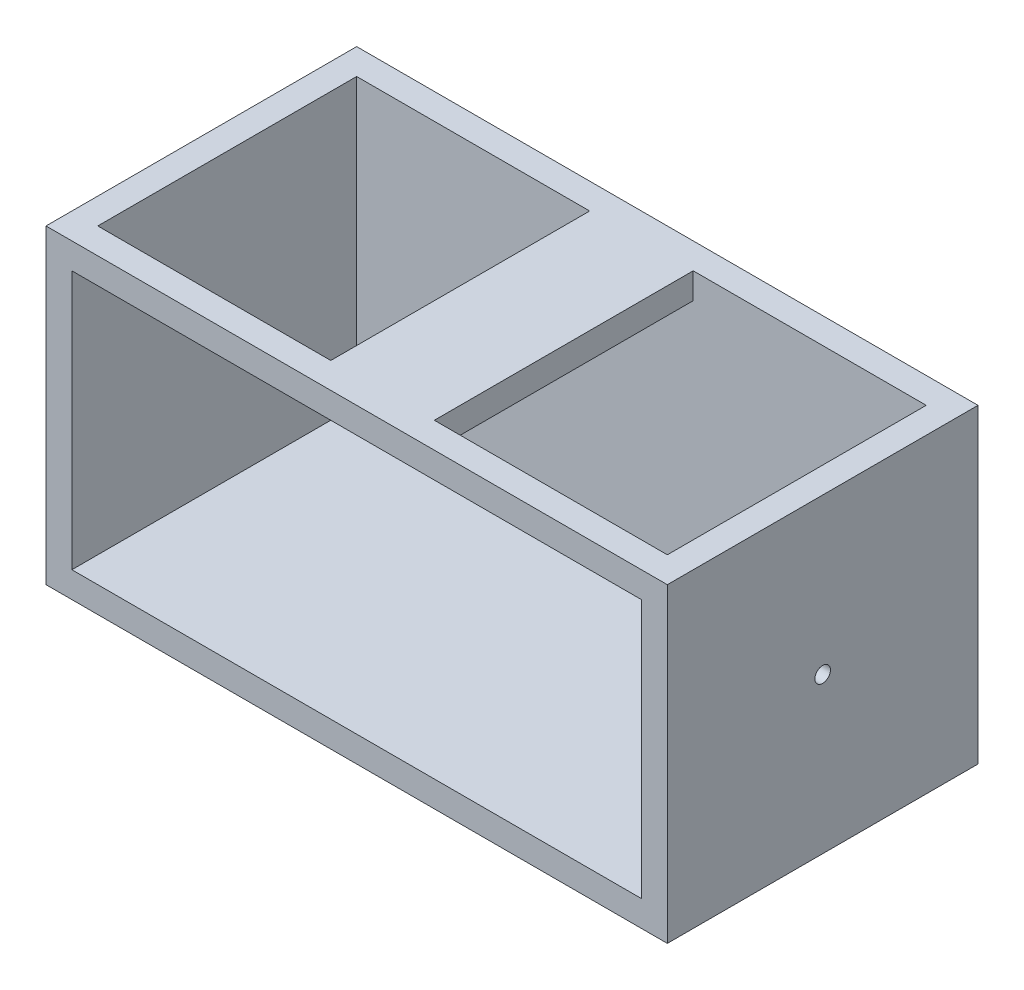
ISO-10303-21;
HEADER;
FILE_DESCRIPTION(('STEP AP214'),'2;1');
FILE_NAME('part.step','',(''),(''),'','','');
FILE_SCHEMA(('AUTOMOTIVE_DESIGN { 1 0 10303 214 1 1 1 1 }'));
ENDSEC;
DATA;
#1=APPLICATION_CONTEXT('core data for automotive mechanical design processes');
#2=APPLICATION_PROTOCOL_DEFINITION('international standard','automotive_design',2000,#1);
#3=PRODUCT_CONTEXT('',#1,'mechanical');
#4=PRODUCT('Part','Part','',(#3));
#5=PRODUCT_RELATED_PRODUCT_CATEGORY('part','',(#4));
#6=PRODUCT_DEFINITION_FORMATION('','',#4);
#7=PRODUCT_DEFINITION_CONTEXT('part definition',#1,'design');
#8=PRODUCT_DEFINITION('design','',#6,#7);
#9=PRODUCT_DEFINITION_SHAPE('','',#8);
#10=(LENGTH_UNIT() NAMED_UNIT(*) SI_UNIT(.MILLI.,.METRE.));
#11=(NAMED_UNIT(*) PLANE_ANGLE_UNIT() SI_UNIT($,.RADIAN.));
#12=(NAMED_UNIT(*) SI_UNIT($,.STERADIAN.) SOLID_ANGLE_UNIT());
#13=UNCERTAINTY_MEASURE_WITH_UNIT(LENGTH_MEASURE(1.E-05),#10,'distance_accuracy_value','');
#14=(GEOMETRIC_REPRESENTATION_CONTEXT(3) GLOBAL_UNCERTAINTY_ASSIGNED_CONTEXT((#13)) GLOBAL_UNIT_ASSIGNED_CONTEXT((#10,
#11,#12)) REPRESENTATION_CONTEXT('',''));
#15=CARTESIAN_POINT('',(0.,0.,0.));
#16=DIRECTION('',(0.,0.,1.));
#17=DIRECTION('',(1.,0.,0.));
#18=AXIS2_PLACEMENT_3D('',#15,#16,#17);
#19=CARTESIAN_POINT('',(-135.,0.,60.));
#20=DIRECTION('',(1.,0.,0.));
#21=DIRECTION('',(0.,0.,-1.));
#22=AXIS2_PLACEMENT_3D('',#19,#20,#21);
#23=CYLINDRICAL_SURFACE('',#22,3.);
#24=CARTESIAN_POINT('',(-120.,0.,60.));
#25=DIRECTION('',(1.,0.,0.));
#26=DIRECTION('',(0.,0.,-1.));
#27=AXIS2_PLACEMENT_3D('',#24,#25,#26);
#28=CIRCLE('',#27,3.);
#29=CARTESIAN_POINT('',(-120.,0.,57.));
#30=VERTEX_POINT('',#29);
#31=EDGE_CURVE('E260',#30,#30,#28,.T.);
#32=ORIENTED_EDGE('',*,*,#31,.F.);
#33=EDGE_LOOP('',(#32));
#34=FACE_BOUND('',#33,.T.);
#35=CARTESIAN_POINT('',(-110.,0.,60.));
#36=DIRECTION('',(1.,0.,0.));
#37=DIRECTION('',(0.,0.,-1.));
#38=AXIS2_PLACEMENT_3D('',#35,#36,#37);
#39=CIRCLE('',#38,3.);
#40=CARTESIAN_POINT('',(-110.,0.,57.));
#41=VERTEX_POINT('',#40);
#42=EDGE_CURVE('E210',#41,#41,#39,.F.);
#43=ORIENTED_EDGE('',*,*,#42,.F.);
#44=EDGE_LOOP('',(#43));
#45=FACE_BOUND('',#44,.T.);
#46=ADVANCED_FACE('F41',(#34,#45),#23,.F.);
#47=CARTESIAN_POINT('',(120.,0.,60.));
#48=DIRECTION('',(1.,0.,0.));
#49=DIRECTION('',(0.,0.,-1.));
#50=AXIS2_PLACEMENT_3D('',#47,#48,#49);
#51=CIRCLE('',#50,3.);
#52=CARTESIAN_POINT('',(120.,0.,57.));
#53=VERTEX_POINT('',#52);
#54=EDGE_CURVE('E222',#53,#53,#51,.T.);
#55=ORIENTED_EDGE('',*,*,#54,.T.);
#56=EDGE_LOOP('',(#55));
#57=FACE_BOUND('',#56,.T.);
#58=CARTESIAN_POINT('',(110.,0.,60.));
#59=DIRECTION('',(-1.,0.,0.));
#60=DIRECTION('',(0.,0.,1.));
#61=AXIS2_PLACEMENT_3D('',#58,#59,#60);
#62=CIRCLE('',#61,3.);
#63=CARTESIAN_POINT('',(110.,0.,63.));
#64=VERTEX_POINT('',#63);
#65=EDGE_CURVE('E206',#64,#64,#62,.F.);
#66=ORIENTED_EDGE('',*,*,#65,.F.);
#67=EDGE_LOOP('',(#66));
#68=FACE_BOUND('',#67,.T.);
#69=ADVANCED_FACE('F310',(#57,#68),#23,.F.);
#70=CARTESIAN_POINT('',(0.,0.,120.));
#71=DIRECTION('',(0.,0.,-1.));
#72=DIRECTION('',(-1.,0.,0.));
#73=AXIS2_PLACEMENT_3D('',#70,#71,#72);
#74=PLANE('',#73);
#75=DIRECTION('',(0.,1.,0.));
#76=VECTOR('',#75,1.);
#77=CARTESIAN_POINT('',(120.,-60.,120.));
#78=LINE('',#77,#76);
#79=CARTESIAN_POINT('',(120.,-60.,120.));
#80=VERTEX_POINT('',#79);
#81=CARTESIAN_POINT('',(120.,60.,120.));
#82=VERTEX_POINT('',#81);
#83=EDGE_CURVE('E261',#80,#82,#78,.T.);
#84=ORIENTED_EDGE('',*,*,#83,.T.);
#85=DIRECTION('',(-1.,0.,0.));
#86=VECTOR('',#85,1.);
#87=CARTESIAN_POINT('',(-120.,60.,120.));
#88=LINE('',#87,#86);
#89=CARTESIAN_POINT('',(-120.,60.,120.));
#90=VERTEX_POINT('',#89);
#91=EDGE_CURVE('E265',#82,#90,#88,.T.);
#92=ORIENTED_EDGE('',*,*,#91,.T.);
#93=DIRECTION('',(0.,-1.,0.));
#94=VECTOR('',#93,1.);
#95=CARTESIAN_POINT('',(-120.,-60.,120.));
#96=LINE('',#95,#94);
#97=CARTESIAN_POINT('',(-120.,-60.,120.));
#98=VERTEX_POINT('',#97);
#99=EDGE_CURVE('E269',#90,#98,#96,.T.);
#100=ORIENTED_EDGE('',*,*,#99,.T.);
#101=DIRECTION('',(1.,0.,0.));
#102=VECTOR('',#101,1.);
#103=CARTESIAN_POINT('',(-120.,-60.,120.));
#104=LINE('',#103,#102);
#105=EDGE_CURVE('E272',#98,#80,#104,.T.);
#106=ORIENTED_EDGE('',*,*,#105,.T.);
#107=EDGE_LOOP('',(#84,#92,#100,#106));
#108=FACE_BOUND('',#107,.T.);
#109=DIRECTION('',(0.,1.,0.));
#110=VECTOR('',#109,1.);
#111=CARTESIAN_POINT('',(110.,0.,120.));
#112=LINE('',#111,#110);
#113=CARTESIAN_POINT('',(110.,-50.,120.));
#114=VERTEX_POINT('',#113);
#115=CARTESIAN_POINT('',(110.,50.,120.));
#116=VERTEX_POINT('',#115);
#117=EDGE_CURVE('E245',#114,#116,#112,.T.);
#118=ORIENTED_EDGE('',*,*,#117,.F.);
#119=DIRECTION('',(1.,0.,0.));
#120=VECTOR('',#119,1.);
#121=CARTESIAN_POINT('',(0.,-50.,120.));
#122=LINE('',#121,#120);
#123=CARTESIAN_POINT('',(-110.,-50.,120.));
#124=VERTEX_POINT('',#123);
#125=EDGE_CURVE('E229',#124,#114,#122,.T.);
#126=ORIENTED_EDGE('',*,*,#125,.F.);
#127=DIRECTION('',(0.,-1.,0.));
#128=VECTOR('',#127,1.);
#129=CARTESIAN_POINT('',(-110.,0.,120.));
#130=LINE('',#129,#128);
#131=CARTESIAN_POINT('',(-110.,50.,120.));
#132=VERTEX_POINT('',#131);
#133=EDGE_CURVE('E251',#132,#124,#130,.T.);
#134=ORIENTED_EDGE('',*,*,#133,.F.);
#135=DIRECTION('',(-1.,0.,0.));
#136=VECTOR('',#135,1.);
#137=CARTESIAN_POINT('',(0.,50.,120.));
#138=LINE('',#137,#136);
#139=EDGE_CURVE('E248',#116,#132,#138,.T.);
#140=ORIENTED_EDGE('',*,*,#139,.F.);
#141=EDGE_LOOP('',(#118,#126,#134,#140));
#142=FACE_BOUND('',#141,.T.);
#143=ADVANCED_FACE('F335',(#108,#142),#74,.F.);
#144=CARTESIAN_POINT('',(120.,-60.,120.));
#145=DIRECTION('',(-1.,0.,0.));
#146=DIRECTION('',(0.,0.,1.));
#147=AXIS2_PLACEMENT_3D('',#144,#145,#146);
#148=PLANE('',#147);
#149=ORIENTED_EDGE('',*,*,#54,.F.);
#150=EDGE_LOOP('',(#149));
#151=FACE_BOUND('',#150,.T.);
#152=DIRECTION('',(0.,1.,0.));
#153=VECTOR('',#152,1.);
#154=CARTESIAN_POINT('',(120.,-60.,0.));
#155=LINE('',#154,#153);
#156=CARTESIAN_POINT('',(120.,-60.,0.));
#157=VERTEX_POINT('',#156);
#158=CARTESIAN_POINT('',(120.,60.,0.));
#159=VERTEX_POINT('',#158);
#160=EDGE_CURVE('E276',#157,#159,#155,.T.);
#161=ORIENTED_EDGE('',*,*,#160,.T.);
#162=DIRECTION('',(0.,0.,-1.));
#163=VECTOR('',#162,1.);
#164=CARTESIAN_POINT('',(120.,60.,120.));
#165=LINE('',#164,#163);
#166=EDGE_CURVE('E50',#82,#159,#165,.T.);
#167=ORIENTED_EDGE('',*,*,#166,.F.);
#168=ORIENTED_EDGE('',*,*,#83,.F.);
#169=DIRECTION('',(0.,0.,-1.));
#170=VECTOR('',#169,1.);
#171=CARTESIAN_POINT('',(120.,-60.,120.));
#172=LINE('',#171,#170);
#173=EDGE_CURVE('E275',#80,#157,#172,.T.);
#174=ORIENTED_EDGE('',*,*,#173,.T.);
#175=EDGE_LOOP('',(#161,#167,#168,#174));
#176=FACE_BOUND('',#175,.T.);
#177=ADVANCED_FACE('F43',(#151,#176),#148,.F.);
#178=CARTESIAN_POINT('',(-120.,60.,120.));
#179=DIRECTION('',(0.,-1.,0.));
#180=DIRECTION('',(0.,0.,-1.));
#181=AXIS2_PLACEMENT_3D('',#178,#179,#180);
#182=PLANE('',#181);
#183=DIRECTION('',(1.,0.,0.));
#184=VECTOR('',#183,1.);
#185=CARTESIAN_POINT('',(-110.,60.,110.));
#186=LINE('',#185,#184);
#187=CARTESIAN_POINT('',(-110.,60.,110.));
#188=VERTEX_POINT('',#187);
#189=CARTESIAN_POINT('',(-20.,60.,110.));
#190=VERTEX_POINT('',#189);
#191=EDGE_CURVE('E154',#188,#190,#186,.T.);
#192=ORIENTED_EDGE('',*,*,#191,.F.);
#193=DIRECTION('',(0.,0.,1.));
#194=VECTOR('',#193,1.);
#195=CARTESIAN_POINT('',(-110.,60.,10.));
#196=LINE('',#195,#194);
#197=CARTESIAN_POINT('',(-110.,60.,10.));
#198=VERTEX_POINT('',#197);
#199=EDGE_CURVE('E57',#198,#188,#196,.T.);
#200=ORIENTED_EDGE('',*,*,#199,.F.);
#201=DIRECTION('',(-1.,0.,0.));
#202=VECTOR('',#201,1.);
#203=CARTESIAN_POINT('',(-110.,60.,10.));
#204=LINE('',#203,#202);
#205=CARTESIAN_POINT('',(-20.,60.,10.));
#206=VERTEX_POINT('',#205);
#207=EDGE_CURVE('E162',#206,#198,#204,.T.);
#208=ORIENTED_EDGE('',*,*,#207,.F.);
#209=DIRECTION('',(0.,0.,-1.));
#210=VECTOR('',#209,1.);
#211=CARTESIAN_POINT('',(-20.,60.,10.));
#212=LINE('',#211,#210);
#213=EDGE_CURVE('E144',#190,#206,#212,.T.);
#214=ORIENTED_EDGE('',*,*,#213,.F.);
#215=EDGE_LOOP('',(#192,#200,#208,#214));
#216=FACE_BOUND('',#215,.T.);
#217=DIRECTION('',(1.,0.,0.));
#218=VECTOR('',#217,1.);
#219=CARTESIAN_POINT('',(20.,60.,110.));
#220=LINE('',#219,#218);
#221=CARTESIAN_POINT('',(20.,60.,110.));
#222=VERTEX_POINT('',#221);
#223=CARTESIAN_POINT('',(110.,60.,110.));
#224=VERTEX_POINT('',#223);
#225=EDGE_CURVE('E181',#222,#224,#220,.T.);
#226=ORIENTED_EDGE('',*,*,#225,.F.);
#227=DIRECTION('',(0.,0.,1.));
#228=VECTOR('',#227,1.);
#229=CARTESIAN_POINT('',(20.,60.,110.));
#230=LINE('',#229,#228);
#231=CARTESIAN_POINT('',(20.,60.,9.99999999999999));
#232=VERTEX_POINT('',#231);
#233=EDGE_CURVE('E178',#232,#222,#230,.T.);
#234=ORIENTED_EDGE('',*,*,#233,.F.);
#235=DIRECTION('',(-1.,0.,0.));
#236=VECTOR('',#235,1.);
#237=CARTESIAN_POINT('',(20.,60.,9.99999999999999));
#238=LINE('',#237,#236);
#239=CARTESIAN_POINT('',(110.,60.,10.));
#240=VERTEX_POINT('',#239);
#241=EDGE_CURVE('E189',#240,#232,#238,.T.);
#242=ORIENTED_EDGE('',*,*,#241,.F.);
#243=DIRECTION('',(0.,0.,-1.));
#244=VECTOR('',#243,1.);
#245=CARTESIAN_POINT('',(110.,60.,110.));
#246=LINE('',#245,#244);
#247=EDGE_CURVE('E185',#224,#240,#246,.T.);
#248=ORIENTED_EDGE('',*,*,#247,.F.);
#249=EDGE_LOOP('',(#226,#234,#242,#248));
#250=FACE_BOUND('',#249,.T.);
#251=DIRECTION('',(-1.,0.,0.));
#252=VECTOR('',#251,1.);
#253=CARTESIAN_POINT('',(-120.,60.,0.));
#254=LINE('',#253,#252);
#255=CARTESIAN_POINT('',(-120.,60.,0.));
#256=VERTEX_POINT('',#255);
#257=EDGE_CURVE('E280',#159,#256,#254,.T.);
#258=ORIENTED_EDGE('',*,*,#257,.T.);
#259=DIRECTION('',(0.,0.,-1.));
#260=VECTOR('',#259,1.);
#261=CARTESIAN_POINT('',(-120.,60.,120.));
#262=LINE('',#261,#260);
#263=EDGE_CURVE('E295',#90,#256,#262,.T.);
#264=ORIENTED_EDGE('',*,*,#263,.F.);
#265=ORIENTED_EDGE('',*,*,#91,.F.);
#266=ORIENTED_EDGE('',*,*,#166,.T.);
#267=EDGE_LOOP('',(#258,#264,#265,#266));
#268=FACE_BOUND('',#267,.T.);
#269=ADVANCED_FACE('F159',(#216,#250,#268),#182,.F.);
#270=CARTESIAN_POINT('',(-120.,-60.,120.));
#271=DIRECTION('',(1.,0.,0.));
#272=DIRECTION('',(0.,0.,-1.));
#273=AXIS2_PLACEMENT_3D('',#270,#271,#272);
#274=PLANE('',#273);
#275=ORIENTED_EDGE('',*,*,#31,.T.);
#276=EDGE_LOOP('',(#275));
#277=FACE_BOUND('',#276,.T.);
#278=DIRECTION('',(0.,-1.,0.));
#279=VECTOR('',#278,1.);
#280=CARTESIAN_POINT('',(-120.,-60.,0.));
#281=LINE('',#280,#279);
#282=CARTESIAN_POINT('',(-120.,-60.,0.));
#283=VERTEX_POINT('',#282);
#284=EDGE_CURVE('E283',#256,#283,#281,.T.);
#285=ORIENTED_EDGE('',*,*,#284,.T.);
#286=DIRECTION('',(0.,0.,-1.));
#287=VECTOR('',#286,1.);
#288=CARTESIAN_POINT('',(-120.,-60.,120.));
#289=LINE('',#288,#287);
#290=EDGE_CURVE('E291',#98,#283,#289,.T.);
#291=ORIENTED_EDGE('',*,*,#290,.F.);
#292=ORIENTED_EDGE('',*,*,#99,.F.);
#293=ORIENTED_EDGE('',*,*,#263,.T.);
#294=EDGE_LOOP('',(#285,#291,#292,#293));
#295=FACE_BOUND('',#294,.T.);
#296=ADVANCED_FACE('F305',(#277,#295),#274,.F.);
#297=CARTESIAN_POINT('',(-120.,-60.,120.));
#298=DIRECTION('',(0.,1.,0.));
#299=DIRECTION('',(0.,0.,1.));
#300=AXIS2_PLACEMENT_3D('',#297,#298,#299);
#301=PLANE('',#300);
#302=DIRECTION('',(1.,0.,0.));
#303=VECTOR('',#302,1.);
#304=CARTESIAN_POINT('',(-120.,-60.,0.));
#305=LINE('',#304,#303);
#306=EDGE_CURVE('E266',#283,#157,#305,.T.);
#307=ORIENTED_EDGE('',*,*,#306,.T.);
#308=ORIENTED_EDGE('',*,*,#173,.F.);
#309=ORIENTED_EDGE('',*,*,#105,.F.);
#310=ORIENTED_EDGE('',*,*,#290,.T.);
#311=EDGE_LOOP('',(#307,#308,#309,#310));
#312=FACE_BOUND('',#311,.T.);
#313=ADVANCED_FACE('F342',(#312),#301,.F.);
#314=CARTESIAN_POINT('',(0.,0.,0.));
#315=DIRECTION('',(0.,0.,-1.));
#316=DIRECTION('',(-1.,0.,0.));
#317=AXIS2_PLACEMENT_3D('',#314,#315,#316);
#318=PLANE('',#317);
#319=ORIENTED_EDGE('',*,*,#160,.F.);
#320=ORIENTED_EDGE('',*,*,#306,.F.);
#321=ORIENTED_EDGE('',*,*,#284,.F.);
#322=ORIENTED_EDGE('',*,*,#257,.F.);
#323=EDGE_LOOP('',(#319,#320,#321,#322));
#324=FACE_BOUND('',#323,.T.);
#325=ADVANCED_FACE('F339',(#324),#318,.T.);
#326=CARTESIAN_POINT('',(110.,-60.,120.));
#327=DIRECTION('',(-1.,0.,0.));
#328=DIRECTION('',(0.,0.,1.));
#329=AXIS2_PLACEMENT_3D('',#326,#327,#328);
#330=PLANE('',#329);
#331=DIRECTION('',(0.,0.,-1.));
#332=VECTOR('',#331,1.);
#333=CARTESIAN_POINT('',(110.,50.,120.));
#334=LINE('',#333,#332);
#335=CARTESIAN_POINT('',(110.,50.,110.));
#336=VERTEX_POINT('',#335);
#337=EDGE_CURVE('E218',#116,#336,#334,.T.);
#338=ORIENTED_EDGE('',*,*,#337,.T.);
#339=DIRECTION('',(0.,1.,0.));
#340=VECTOR('',#339,1.);
#341=CARTESIAN_POINT('',(110.,35.,110.));
#342=LINE('',#341,#340);
#343=EDGE_CURVE('E198',#336,#224,#342,.T.);
#344=ORIENTED_EDGE('',*,*,#343,.T.);
#345=ORIENTED_EDGE('',*,*,#247,.T.);
#346=DIRECTION('',(0.,1.,0.));
#347=VECTOR('',#346,1.);
#348=CARTESIAN_POINT('',(110.,0.,10.));
#349=LINE('',#348,#347);
#350=CARTESIAN_POINT('',(110.,-50.,10.));
#351=VERTEX_POINT('',#350);
#352=EDGE_CURVE('E214',#351,#240,#349,.T.);
#353=ORIENTED_EDGE('',*,*,#352,.F.);
#354=DIRECTION('',(0.,0.,-1.));
#355=VECTOR('',#354,1.);
#356=CARTESIAN_POINT('',(110.,-50.,120.));
#357=LINE('',#356,#355);
#358=EDGE_CURVE('E224',#114,#351,#357,.T.);
#359=ORIENTED_EDGE('',*,*,#358,.F.);
#360=ORIENTED_EDGE('',*,*,#117,.T.);
#361=EDGE_LOOP('',(#338,#344,#345,#353,#359,#360));
#362=FACE_BOUND('',#361,.T.);
#363=ORIENTED_EDGE('',*,*,#65,.T.);
#364=EDGE_LOOP('',(#363));
#365=FACE_BOUND('',#364,.T.);
#366=ADVANCED_FACE('F326',(#362,#365),#330,.T.);
#367=CARTESIAN_POINT('',(-120.,50.,120.));
#368=DIRECTION('',(0.,-1.,0.));
#369=DIRECTION('',(0.,0.,-1.));
#370=AXIS2_PLACEMENT_3D('',#367,#368,#369);
#371=PLANE('',#370);
#372=DIRECTION('',(0.,0.,1.));
#373=VECTOR('',#372,1.);
#374=CARTESIAN_POINT('',(-20.,50.,120.));
#375=LINE('',#374,#373);
#376=CARTESIAN_POINT('',(-20.,50.,10.));
#377=VERTEX_POINT('',#376);
#378=CARTESIAN_POINT('',(-20.,50.,110.));
#379=VERTEX_POINT('',#378);
#380=EDGE_CURVE('E147',#377,#379,#375,.T.);
#381=ORIENTED_EDGE('',*,*,#380,.F.);
#382=DIRECTION('',(-1.,0.,0.));
#383=VECTOR('',#382,1.);
#384=CARTESIAN_POINT('',(0.,50.,10.));
#385=LINE('',#384,#383);
#386=CARTESIAN_POINT('',(20.,50.,9.99999999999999));
#387=VERTEX_POINT('',#386);
#388=EDGE_CURVE('E217',#387,#377,#385,.T.);
#389=ORIENTED_EDGE('',*,*,#388,.F.);
#390=DIRECTION('',(0.,0.,-1.));
#391=VECTOR('',#390,1.);
#392=CARTESIAN_POINT('',(20.,50.,120.));
#393=LINE('',#392,#391);
#394=CARTESIAN_POINT('',(20.,50.,110.));
#395=VERTEX_POINT('',#394);
#396=EDGE_CURVE('E197',#395,#387,#393,.T.);
#397=ORIENTED_EDGE('',*,*,#396,.F.);
#398=DIRECTION('',(-1.,0.,0.));
#399=VECTOR('',#398,1.);
#400=CARTESIAN_POINT('',(-120.,50.,110.));
#401=LINE('',#400,#399);
#402=EDGE_CURVE('E11',#336,#395,#401,.T.);
#403=ORIENTED_EDGE('',*,*,#402,.F.);
#404=ORIENTED_EDGE('',*,*,#337,.F.);
#405=ORIENTED_EDGE('',*,*,#139,.T.);
#406=DIRECTION('',(0.,0.,-1.));
#407=VECTOR('',#406,1.);
#408=CARTESIAN_POINT('',(-110.,50.,120.));
#409=LINE('',#408,#407);
#410=CARTESIAN_POINT('',(-110.,50.,110.));
#411=VERTEX_POINT('',#410);
#412=EDGE_CURVE('E223',#132,#411,#409,.T.);
#413=ORIENTED_EDGE('',*,*,#412,.T.);
#414=DIRECTION('',(-1.,0.,0.));
#415=VECTOR('',#414,1.);
#416=CARTESIAN_POINT('',(-120.,50.,110.));
#417=LINE('',#416,#415);
#418=EDGE_CURVE('E175',#379,#411,#417,.T.);
#419=ORIENTED_EDGE('',*,*,#418,.F.);
#420=EDGE_LOOP('',(#381,#389,#397,#403,#404,#405,#413,#419));
#421=FACE_BOUND('',#420,.T.);
#422=ADVANCED_FACE('F317',(#421),#371,.T.);
#423=CARTESIAN_POINT('',(-110.,-60.,120.));
#424=DIRECTION('',(1.,0.,0.));
#425=DIRECTION('',(0.,0.,-1.));
#426=AXIS2_PLACEMENT_3D('',#423,#424,#425);
#427=PLANE('',#426);
#428=DIRECTION('',(0.,-1.,0.));
#429=VECTOR('',#428,1.);
#430=CARTESIAN_POINT('',(-110.,0.,10.));
#431=LINE('',#430,#429);
#432=CARTESIAN_POINT('',(-110.,-50.,10.));
#433=VERTEX_POINT('',#432);
#434=EDGE_CURVE('E233',#198,#433,#431,.T.);
#435=ORIENTED_EDGE('',*,*,#434,.F.);
#436=ORIENTED_EDGE('',*,*,#199,.T.);
#437=DIRECTION('',(0.,1.,0.));
#438=VECTOR('',#437,1.);
#439=CARTESIAN_POINT('',(-110.,35.,110.));
#440=LINE('',#439,#438);
#441=EDGE_CURVE('E151',#411,#188,#440,.T.);
#442=ORIENTED_EDGE('',*,*,#441,.F.);
#443=ORIENTED_EDGE('',*,*,#412,.F.);
#444=ORIENTED_EDGE('',*,*,#133,.T.);
#445=DIRECTION('',(0.,0.,-1.));
#446=VECTOR('',#445,1.);
#447=CARTESIAN_POINT('',(-110.,-50.,120.));
#448=LINE('',#447,#446);
#449=EDGE_CURVE('E228',#124,#433,#448,.T.);
#450=ORIENTED_EDGE('',*,*,#449,.T.);
#451=EDGE_LOOP('',(#435,#436,#442,#443,#444,#450));
#452=FACE_BOUND('',#451,.T.);
#453=ORIENTED_EDGE('',*,*,#42,.T.);
#454=EDGE_LOOP('',(#453));
#455=FACE_BOUND('',#454,.T.);
#456=ADVANCED_FACE('F314',(#452,#455),#427,.T.);
#457=CARTESIAN_POINT('',(-120.,-50.,120.));
#458=DIRECTION('',(0.,1.,0.));
#459=DIRECTION('',(0.,0.,1.));
#460=AXIS2_PLACEMENT_3D('',#457,#458,#459);
#461=PLANE('',#460);
#462=DIRECTION('',(1.,0.,0.));
#463=VECTOR('',#462,1.);
#464=CARTESIAN_POINT('',(0.,-50.,10.));
#465=LINE('',#464,#463);
#466=EDGE_CURVE('E239',#433,#351,#465,.T.);
#467=ORIENTED_EDGE('',*,*,#466,.F.);
#468=ORIENTED_EDGE('',*,*,#449,.F.);
#469=ORIENTED_EDGE('',*,*,#125,.T.);
#470=ORIENTED_EDGE('',*,*,#358,.T.);
#471=EDGE_LOOP('',(#467,#468,#469,#470));
#472=FACE_BOUND('',#471,.T.);
#473=ADVANCED_FACE('F316',(#472),#461,.T.);
#474=CARTESIAN_POINT('',(0.,0.,10.));
#475=DIRECTION('',(0.,0.,-1.));
#476=DIRECTION('',(-1.,0.,0.));
#477=AXIS2_PLACEMENT_3D('',#474,#475,#476);
#478=PLANE('',#477);
#479=ORIENTED_EDGE('',*,*,#388,.T.);
#480=DIRECTION('',(0.,1.,0.));
#481=VECTOR('',#480,1.);
#482=CARTESIAN_POINT('',(-20.,35.,10.));
#483=LINE('',#482,#481);
#484=EDGE_CURVE('E150',#377,#206,#483,.T.);
#485=ORIENTED_EDGE('',*,*,#484,.T.);
#486=ORIENTED_EDGE('',*,*,#207,.T.);
#487=ORIENTED_EDGE('',*,*,#434,.T.);
#488=ORIENTED_EDGE('',*,*,#466,.T.);
#489=ORIENTED_EDGE('',*,*,#352,.T.);
#490=ORIENTED_EDGE('',*,*,#241,.T.);
#491=DIRECTION('',(0.,1.,0.));
#492=VECTOR('',#491,1.);
#493=CARTESIAN_POINT('',(20.,35.,9.99999999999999));
#494=LINE('',#493,#492);
#495=EDGE_CURVE('E194',#387,#232,#494,.T.);
#496=ORIENTED_EDGE('',*,*,#495,.F.);
#497=EDGE_LOOP('',(#479,#485,#486,#487,#488,#489,#490,#496));
#498=FACE_BOUND('',#497,.T.);
#499=ADVANCED_FACE('F323',(#498),#478,.F.);
#500=CARTESIAN_POINT('',(20.,35.,110.));
#501=DIRECTION('',(-1.,0.,0.));
#502=DIRECTION('',(0.,0.,1.));
#503=AXIS2_PLACEMENT_3D('',#500,#501,#502);
#504=PLANE('',#503);
#505=ORIENTED_EDGE('',*,*,#396,.T.);
#506=ORIENTED_EDGE('',*,*,#495,.T.);
#507=ORIENTED_EDGE('',*,*,#233,.T.);
#508=DIRECTION('',(0.,1.,0.));
#509=VECTOR('',#508,1.);
#510=CARTESIAN_POINT('',(20.,35.,110.));
#511=LINE('',#510,#509);
#512=EDGE_CURVE('E193',#395,#222,#511,.T.);
#513=ORIENTED_EDGE('',*,*,#512,.F.);
#514=EDGE_LOOP('',(#505,#506,#507,#513));
#515=FACE_BOUND('',#514,.T.);
#516=ADVANCED_FACE('F332',(#515),#504,.F.);
#517=CARTESIAN_POINT('',(20.,35.,110.));
#518=DIRECTION('',(0.,0.,1.));
#519=DIRECTION('',(1.,0.,0.));
#520=AXIS2_PLACEMENT_3D('',#517,#518,#519);
#521=PLANE('',#520);
#522=ORIENTED_EDGE('',*,*,#402,.T.);
#523=ORIENTED_EDGE('',*,*,#512,.T.);
#524=ORIENTED_EDGE('',*,*,#225,.T.);
#525=ORIENTED_EDGE('',*,*,#343,.F.);
#526=EDGE_LOOP('',(#522,#523,#524,#525));
#527=FACE_BOUND('',#526,.T.);
#528=ADVANCED_FACE('F384',(#527),#521,.F.);
#529=CARTESIAN_POINT('',(-20.,35.,10.));
#530=DIRECTION('',(1.,0.,0.));
#531=DIRECTION('',(0.,0.,-1.));
#532=AXIS2_PLACEMENT_3D('',#529,#530,#531);
#533=PLANE('',#532);
#534=ORIENTED_EDGE('',*,*,#380,.T.);
#535=DIRECTION('',(0.,1.,0.));
#536=VECTOR('',#535,1.);
#537=CARTESIAN_POINT('',(-20.,35.,110.));
#538=LINE('',#537,#536);
#539=EDGE_CURVE('E65',#379,#190,#538,.T.);
#540=ORIENTED_EDGE('',*,*,#539,.T.);
#541=ORIENTED_EDGE('',*,*,#213,.T.);
#542=ORIENTED_EDGE('',*,*,#484,.F.);
#543=EDGE_LOOP('',(#534,#540,#541,#542));
#544=FACE_BOUND('',#543,.T.);
#545=ADVANCED_FACE('F142',(#544),#533,.F.);
#546=CARTESIAN_POINT('',(-110.,35.,110.));
#547=DIRECTION('',(0.,0.,1.));
#548=DIRECTION('',(1.,0.,0.));
#549=AXIS2_PLACEMENT_3D('',#546,#547,#548);
#550=PLANE('',#549);
#551=ORIENTED_EDGE('',*,*,#418,.T.);
#552=ORIENTED_EDGE('',*,*,#441,.T.);
#553=ORIENTED_EDGE('',*,*,#191,.T.);
#554=ORIENTED_EDGE('',*,*,#539,.F.);
#555=EDGE_LOOP('',(#551,#552,#553,#554));
#556=FACE_BOUND('',#555,.T.);
#557=ADVANCED_FACE('F155',(#556),#550,.F.);
#558=CLOSED_SHELL('',(#46,#69,#143,#177,#269,#296,#313,#325,#366,#422,#456,#473,#499,#516,#528,
#545,#557));
#559=MANIFOLD_SOLID_BREP('B2',#558);
#560=ADVANCED_BREP_SHAPE_REPRESENTATION('',(#18,#559),#14);
#561=SHAPE_DEFINITION_REPRESENTATION(#9,#560);
ENDSEC;
END-ISO-10303-21;
